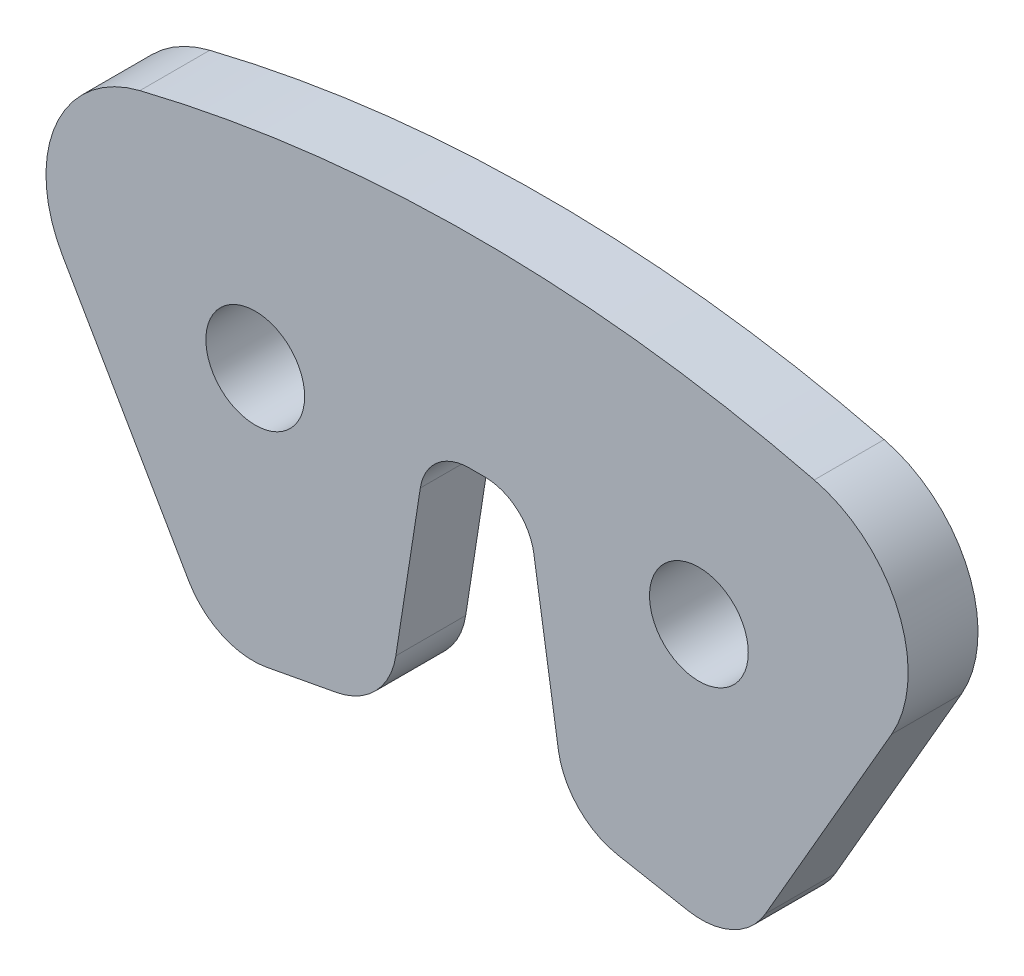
ISO-10303-21;
HEADER;
FILE_DESCRIPTION(('STEP AP214'),'2;1');
FILE_NAME('part.step','',(''),(''),'','','');
FILE_SCHEMA(('AUTOMOTIVE_DESIGN { 1 0 10303 214 1 1 1 1 }'));
ENDSEC;
DATA;
#1=APPLICATION_CONTEXT('core data for automotive mechanical design processes');
#2=APPLICATION_PROTOCOL_DEFINITION('international standard','automotive_design',2000,#1);
#3=PRODUCT_CONTEXT('',#1,'mechanical');
#4=PRODUCT('Part','Part','',(#3));
#5=PRODUCT_RELATED_PRODUCT_CATEGORY('part','',(#4));
#6=PRODUCT_DEFINITION_FORMATION('','',#4);
#7=PRODUCT_DEFINITION_CONTEXT('part definition',#1,'design');
#8=PRODUCT_DEFINITION('design','',#6,#7);
#9=PRODUCT_DEFINITION_SHAPE('','',#8);
#10=(LENGTH_UNIT() NAMED_UNIT(*) SI_UNIT(.MILLI.,.METRE.));
#11=(NAMED_UNIT(*) PLANE_ANGLE_UNIT() SI_UNIT($,.RADIAN.));
#12=(NAMED_UNIT(*) SI_UNIT($,.STERADIAN.) SOLID_ANGLE_UNIT());
#13=UNCERTAINTY_MEASURE_WITH_UNIT(LENGTH_MEASURE(1.E-05),#10,'distance_accuracy_value','');
#14=(GEOMETRIC_REPRESENTATION_CONTEXT(3) GLOBAL_UNCERTAINTY_ASSIGNED_CONTEXT((#13)) GLOBAL_UNIT_ASSIGNED_CONTEXT((#10,
#11,#12)) REPRESENTATION_CONTEXT('',''));
#15=CARTESIAN_POINT('',(0.,0.,0.));
#16=DIRECTION('',(0.,0.,1.));
#17=DIRECTION('',(1.,0.,0.));
#18=AXIS2_PLACEMENT_3D('',#15,#16,#17);
#19=CARTESIAN_POINT('',(0.,0.,0.75));
#20=DIRECTION('',(0.,0.,1.));
#21=DIRECTION('',(1.,0.,0.));
#22=AXIS2_PLACEMENT_3D('',#19,#20,#21);
#23=PLANE('',#22);
#24=CARTESIAN_POINT('',(-4.76250000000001,25.4771247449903,0.75));
#25=DIRECTION('',(0.,0.,1.));
#26=DIRECTION('',(1.,0.,0.));
#27=AXIS2_PLACEMENT_3D('',#24,#25,#26);
#28=CIRCLE('',#27,1.06000000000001);
#29=CARTESIAN_POINT('',(-3.70250000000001,25.4771247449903,0.75));
#30=VERTEX_POINT('',#29);
#31=EDGE_CURVE('E282',#30,#30,#28,.T.);
#32=ORIENTED_EDGE('',*,*,#31,.F.);
#33=EDGE_LOOP('',(#32));
#34=FACE_BOUND('',#33,.T.);
#35=DIRECTION('',(0.982973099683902,-0.183749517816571,0.));
#36=VECTOR('',#35,1.);
#37=CARTESIAN_POINT('',(1.91673165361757,20.5238893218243,0.75));
#38=LINE('',#37,#36);
#39=CARTESIAN_POINT('',(3.02310493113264,20.3170723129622,0.75));
#40=VERTEX_POINT('',#39);
#41=CARTESIAN_POINT('',(4.52041165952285,20.0371771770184,0.75));
#42=VERTEX_POINT('',#41);
#43=EDGE_CURVE('E262',#40,#42,#38,.T.);
#44=ORIENTED_EDGE('',*,*,#43,.T.);
#45=CARTESIAN_POINT('',(4.8125733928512,21.6001044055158,0.75));
#46=DIRECTION('',(0.,0.,1.));
#47=DIRECTION('',(1.,0.,0.));
#48=AXIS2_PLACEMENT_3D('',#45,#46,#47);
#49=CIRCLE('',#48,1.59);
#50=CARTESIAN_POINT('',(6.18955378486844,20.8051044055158,0.75));
#51=VERTEX_POINT('',#50);
#52=EDGE_CURVE('E220',#42,#51,#49,.T.);
#53=ORIENTED_EDGE('',*,*,#52,.T.);
#54=DIRECTION('',(0.500000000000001,0.866025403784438,0.));
#55=VECTOR('',#54,1.);
#56=CARTESIAN_POINT('',(5.62678493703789,19.8303601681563,0.75));
#57=LINE('',#56,#55);
#58=CARTESIAN_POINT('',(8.90061392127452,25.5007983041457,0.75));
#59=VERTEX_POINT('',#58);
#60=EDGE_CURVE('E295',#51,#59,#57,.T.);
#61=ORIENTED_EDGE('',*,*,#60,.T.);
#62=CARTESIAN_POINT('',(6.60564660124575,26.8257983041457,0.75));
#63=DIRECTION('',(0.,0.,1.));
#64=DIRECTION('',(1.,0.,0.));
#65=AXIS2_PLACEMENT_3D('',#62,#63,#64);
#66=CIRCLE('',#65,2.65);
#67=CARTESIAN_POINT('',(7.239261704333,29.3989348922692,0.75));
#68=VERTEX_POINT('',#67);
#69=EDGE_CURVE('E192',#59,#68,#66,.T.);
#70=ORIENTED_EDGE('',*,*,#69,.T.);
#71=CARTESIAN_POINT('',(0.,0.,0.75));
#72=DIRECTION('',(0.,0.,1.));
#73=DIRECTION('',(1.,0.,0.));
#74=AXIS2_PLACEMENT_3D('',#71,#72,#73);
#75=CIRCLE('',#74,30.2771247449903);
#76=CARTESIAN_POINT('',(-7.239261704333,29.3989348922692,0.75));
#77=VERTEX_POINT('',#76);
#78=EDGE_CURVE('E162',#68,#77,#75,.T.);
#79=ORIENTED_EDGE('',*,*,#78,.T.);
#80=CARTESIAN_POINT('',(-6.60564660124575,26.8257983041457,0.75));
#81=DIRECTION('',(0.,0.,1.));
#82=DIRECTION('',(1.,0.,0.));
#83=AXIS2_PLACEMENT_3D('',#80,#81,#82);
#84=CIRCLE('',#83,2.65);
#85=CARTESIAN_POINT('',(-8.90061392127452,25.5007983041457,0.75));
#86=VERTEX_POINT('',#85);
#87=EDGE_CURVE('E190',#77,#86,#84,.T.);
#88=ORIENTED_EDGE('',*,*,#87,.T.);
#89=DIRECTION('',(0.500000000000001,-0.866025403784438,0.));
#90=VECTOR('',#89,1.);
#91=CARTESIAN_POINT('',(-5.62678493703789,19.8303601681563,0.75));
#92=LINE('',#91,#90);
#93=CARTESIAN_POINT('',(-6.18955378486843,20.8051044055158,0.75));
#94=VERTEX_POINT('',#93);
#95=EDGE_CURVE('E278',#86,#94,#92,.T.);
#96=ORIENTED_EDGE('',*,*,#95,.T.);
#97=CARTESIAN_POINT('',(-4.81257339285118,21.6001044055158,0.75));
#98=DIRECTION('',(0.,0.,1.));
#99=DIRECTION('',(1.,0.,0.));
#100=AXIS2_PLACEMENT_3D('',#97,#98,#99);
#101=CIRCLE('',#100,1.59);
#102=CARTESIAN_POINT('',(-4.52041165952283,20.0371771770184,0.75));
#103=VERTEX_POINT('',#102);
#104=EDGE_CURVE('E214',#94,#103,#101,.T.);
#105=ORIENTED_EDGE('',*,*,#104,.T.);
#106=DIRECTION('',(0.982973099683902,0.183749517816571,0.));
#107=VECTOR('',#106,1.);
#108=CARTESIAN_POINT('',(-1.91673165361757,20.5238893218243,0.75));
#109=LINE('',#108,#107);
#110=CARTESIAN_POINT('',(-3.02310493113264,20.3170723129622,0.75));
#111=VERTEX_POINT('',#110);
#112=EDGE_CURVE('E275',#103,#111,#109,.T.);
#113=ORIENTED_EDGE('',*,*,#112,.T.);
#114=CARTESIAN_POINT('',(-3.31526666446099,21.8799995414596,0.75));
#115=DIRECTION('',(0.,0.,1.));
#116=DIRECTION('',(1.,0.,0.));
#117=AXIS2_PLACEMENT_3D('',#114,#115,#116);
#118=CIRCLE('',#117,1.59);
#119=CARTESIAN_POINT('',(-1.74408356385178,21.6361068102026,0.75));
#120=VERTEX_POINT('',#119);
#121=EDGE_CURVE('E216',#111,#120,#118,.T.);
#122=ORIENTED_EDGE('',*,*,#121,.T.);
#123=DIRECTION('',(0.153391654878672,0.988165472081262,0.));
#124=VECTOR('',#123,1.);
#125=CARTESIAN_POINT('',(-1.08285610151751,25.8958049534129,0.75));
#126=LINE('',#125,#124);
#127=CARTESIAN_POINT('',(-1.21873781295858,25.0204404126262,0.75));
#128=VERTEX_POINT('',#127);
#129=EDGE_CURVE('E271',#120,#128,#126,.T.);
#130=ORIENTED_EDGE('',*,*,#129,.T.);
#131=CARTESIAN_POINT('',(-0.171282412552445,24.8578452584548,0.75));
#132=DIRECTION('',(0.,0.,1.));
#133=DIRECTION('',(1.,0.,0.));
#134=AXIS2_PLACEMENT_3D('',#131,#132,#133);
#135=CIRCLE('',#134,1.06);
#136=CARTESIAN_POINT('',(-0.178586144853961,25.9178200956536,0.75));
#137=VERTEX_POINT('',#136);
#138=EDGE_CURVE('E11',#128,#137,#135,.F.);
#139=ORIENTED_EDGE('',*,*,#138,.T.);
#140=CARTESIAN_POINT('',(0.,0.,0.75));
#141=DIRECTION('',(0.,0.,-1.));
#142=DIRECTION('',(1.,0.,0.));
#143=AXIS2_PLACEMENT_3D('',#140,#141,#142);
#144=CIRCLE('',#143,25.918435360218);
#145=CARTESIAN_POINT('',(0.178586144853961,25.9178200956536,0.75));
#146=VERTEX_POINT('',#145);
#147=EDGE_CURVE('E186',#137,#146,#144,.T.);
#148=ORIENTED_EDGE('',*,*,#147,.T.);
#149=CARTESIAN_POINT('',(0.171282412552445,24.8578452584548,0.75));
#150=DIRECTION('',(0.,0.,1.));
#151=DIRECTION('',(1.,0.,0.));
#152=AXIS2_PLACEMENT_3D('',#149,#150,#151);
#153=CIRCLE('',#152,1.06);
#154=CARTESIAN_POINT('',(1.21873781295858,25.0204404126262,0.75));
#155=VERTEX_POINT('',#154);
#156=EDGE_CURVE('E246',#146,#155,#153,.F.);
#157=ORIENTED_EDGE('',*,*,#156,.T.);
#158=DIRECTION('',(0.153391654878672,-0.988165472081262,0.));
#159=VECTOR('',#158,1.);
#160=CARTESIAN_POINT('',(1.08285610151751,25.8958049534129,0.75));
#161=LINE('',#160,#159);
#162=CARTESIAN_POINT('',(1.74408356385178,21.6361068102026,0.75));
#163=VERTEX_POINT('',#162);
#164=EDGE_CURVE('E185',#155,#163,#161,.T.);
#165=ORIENTED_EDGE('',*,*,#164,.T.);
#166=CARTESIAN_POINT('',(3.31526666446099,21.8799995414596,0.75));
#167=DIRECTION('',(0.,0.,1.));
#168=DIRECTION('',(1.,0.,0.));
#169=AXIS2_PLACEMENT_3D('',#166,#167,#168);
#170=CIRCLE('',#169,1.59);
#171=EDGE_CURVE('E218',#163,#40,#170,.T.);
#172=ORIENTED_EDGE('',*,*,#171,.T.);
#173=EDGE_LOOP('',(#44,#53,#61,#70,#79,#88,#96,#105,#113,#122,#130,#139,#148,#157,#165,#172));
#174=FACE_BOUND('',#173,.T.);
#175=CARTESIAN_POINT('',(4.76250000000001,25.4771247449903,0.75));
#176=DIRECTION('',(0.,0.,1.));
#177=DIRECTION('',(1.,0.,0.));
#178=AXIS2_PLACEMENT_3D('',#175,#176,#177);
#179=CIRCLE('',#178,1.06000000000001);
#180=CARTESIAN_POINT('',(5.82250000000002,25.4771247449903,0.75));
#181=VERTEX_POINT('',#180);
#182=EDGE_CURVE('E353',#181,#181,#179,.T.);
#183=ORIENTED_EDGE('',*,*,#182,.F.);
#184=EDGE_LOOP('',(#183));
#185=FACE_BOUND('',#184,.T.);
#186=ADVANCED_FACE('F30',(#34,#174,#185),#23,.T.);
#187=CARTESIAN_POINT('',(0.,0.,-0.75));
#188=DIRECTION('',(0.,0.,1.));
#189=DIRECTION('',(1.,0.,0.));
#190=AXIS2_PLACEMENT_3D('',#187,#188,#189);
#191=PLANE('',#190);
#192=CARTESIAN_POINT('',(-4.76250000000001,25.4771247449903,-0.75));
#193=DIRECTION('',(0.,0.,1.));
#194=DIRECTION('',(1.,0.,0.));
#195=AXIS2_PLACEMENT_3D('',#192,#193,#194);
#196=CIRCLE('',#195,1.06000000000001);
#197=CARTESIAN_POINT('',(-3.70250000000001,25.4771247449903,-0.75));
#198=VERTEX_POINT('',#197);
#199=EDGE_CURVE('E358',#198,#198,#196,.T.);
#200=ORIENTED_EDGE('',*,*,#199,.T.);
#201=EDGE_LOOP('',(#200));
#202=FACE_BOUND('',#201,.T.);
#203=DIRECTION('',(0.499999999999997,0.86602540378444,0.));
#204=VECTOR('',#203,1.);
#205=CARTESIAN_POINT('',(8.11988054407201,24.1485284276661,-0.75));
#206=LINE('',#205,#204);
#207=CARTESIAN_POINT('',(6.18955378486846,20.8051044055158,-0.75));
#208=VERTEX_POINT('',#207);
#209=CARTESIAN_POINT('',(8.90061392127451,25.5007983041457,-0.75));
#210=VERTEX_POINT('',#209);
#211=EDGE_CURVE('E169',#208,#210,#206,.T.);
#212=ORIENTED_EDGE('',*,*,#211,.F.);
#213=CARTESIAN_POINT('',(4.8125733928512,21.6001044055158,-0.75));
#214=DIRECTION('',(0.,0.,1.));
#215=DIRECTION('',(1.,0.,0.));
#216=AXIS2_PLACEMENT_3D('',#213,#214,#215);
#217=CIRCLE('',#216,1.59);
#218=CARTESIAN_POINT('',(4.52041165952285,20.0371771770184,-0.75));
#219=VERTEX_POINT('',#218);
#220=EDGE_CURVE('E207',#208,#219,#217,.F.);
#221=ORIENTED_EDGE('',*,*,#220,.T.);
#222=DIRECTION('',(0.982973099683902,-0.183749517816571,0.));
#223=VECTOR('',#222,1.);
#224=CARTESIAN_POINT('',(1.91673165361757,20.5238893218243,-0.75));
#225=LINE('',#224,#223);
#226=CARTESIAN_POINT('',(3.02310493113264,20.3170723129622,-0.75));
#227=VERTEX_POINT('',#226);
#228=EDGE_CURVE('E174',#227,#219,#225,.T.);
#229=ORIENTED_EDGE('',*,*,#228,.F.);
#230=CARTESIAN_POINT('',(3.31526666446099,21.8799995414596,-0.75));
#231=DIRECTION('',(0.,0.,1.));
#232=DIRECTION('',(1.,0.,0.));
#233=AXIS2_PLACEMENT_3D('',#230,#231,#232);
#234=CIRCLE('',#233,1.59);
#235=CARTESIAN_POINT('',(1.74408356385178,21.6361068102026,-0.75));
#236=VERTEX_POINT('',#235);
#237=EDGE_CURVE('E204',#227,#236,#234,.F.);
#238=ORIENTED_EDGE('',*,*,#237,.T.);
#239=DIRECTION('',(0.153391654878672,-0.988165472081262,0.));
#240=VECTOR('',#239,1.);
#241=CARTESIAN_POINT('',(1.08285610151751,25.8958049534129,-0.75));
#242=LINE('',#241,#240);
#243=CARTESIAN_POINT('',(1.21873781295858,25.0204404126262,-0.75));
#244=VERTEX_POINT('',#243);
#245=EDGE_CURVE('E265',#244,#236,#242,.T.);
#246=ORIENTED_EDGE('',*,*,#245,.F.);
#247=CARTESIAN_POINT('',(0.171282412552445,24.8578452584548,-0.75));
#248=DIRECTION('',(0.,0.,1.));
#249=DIRECTION('',(1.,0.,0.));
#250=AXIS2_PLACEMENT_3D('',#247,#248,#249);
#251=CIRCLE('',#250,1.06);
#252=CARTESIAN_POINT('',(0.178586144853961,25.9178200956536,-0.75));
#253=VERTEX_POINT('',#252);
#254=EDGE_CURVE('E244',#244,#253,#251,.T.);
#255=ORIENTED_EDGE('',*,*,#254,.T.);
#256=CARTESIAN_POINT('',(0.,0.,-0.75));
#257=DIRECTION('',(0.,0.,-1.));
#258=DIRECTION('',(1.,0.,0.));
#259=AXIS2_PLACEMENT_3D('',#256,#257,#258);
#260=CIRCLE('',#259,25.918435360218);
#261=CARTESIAN_POINT('',(-0.178586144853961,25.9178200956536,-0.75));
#262=VERTEX_POINT('',#261);
#263=EDGE_CURVE('E182',#262,#253,#260,.T.);
#264=ORIENTED_EDGE('',*,*,#263,.F.);
#265=CARTESIAN_POINT('',(-0.171282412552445,24.8578452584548,-0.75));
#266=DIRECTION('',(0.,0.,1.));
#267=DIRECTION('',(1.,0.,0.));
#268=AXIS2_PLACEMENT_3D('',#265,#266,#267);
#269=CIRCLE('',#268,1.06);
#270=CARTESIAN_POINT('',(-1.21873781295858,25.0204404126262,-0.75));
#271=VERTEX_POINT('',#270);
#272=EDGE_CURVE('E38',#262,#271,#269,.T.);
#273=ORIENTED_EDGE('',*,*,#272,.T.);
#274=DIRECTION('',(0.153391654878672,0.988165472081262,0.));
#275=VECTOR('',#274,1.);
#276=CARTESIAN_POINT('',(-1.08285610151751,25.8958049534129,-0.75));
#277=LINE('',#276,#275);
#278=CARTESIAN_POINT('',(-1.74408356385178,21.6361068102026,-0.75));
#279=VERTEX_POINT('',#278);
#280=EDGE_CURVE('E180',#279,#271,#277,.T.);
#281=ORIENTED_EDGE('',*,*,#280,.F.);
#282=CARTESIAN_POINT('',(-3.31526666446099,21.8799995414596,-0.75));
#283=DIRECTION('',(0.,0.,1.));
#284=DIRECTION('',(1.,0.,0.));
#285=AXIS2_PLACEMENT_3D('',#282,#283,#284);
#286=CIRCLE('',#285,1.59);
#287=CARTESIAN_POINT('',(-3.02310493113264,20.3170723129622,-0.75));
#288=VERTEX_POINT('',#287);
#289=EDGE_CURVE('E202',#279,#288,#286,.F.);
#290=ORIENTED_EDGE('',*,*,#289,.T.);
#291=DIRECTION('',(0.982973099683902,0.183749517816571,0.));
#292=VECTOR('',#291,1.);
#293=CARTESIAN_POINT('',(-1.91673165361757,20.5238893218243,-0.75));
#294=LINE('',#293,#292);
#295=CARTESIAN_POINT('',(-4.52041165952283,20.0371771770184,-0.75));
#296=VERTEX_POINT('',#295);
#297=EDGE_CURVE('E172',#296,#288,#294,.T.);
#298=ORIENTED_EDGE('',*,*,#297,.F.);
#299=CARTESIAN_POINT('',(-4.81257339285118,21.6001044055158,-0.75));
#300=DIRECTION('',(0.,0.,1.));
#301=DIRECTION('',(1.,0.,0.));
#302=AXIS2_PLACEMENT_3D('',#299,#300,#301);
#303=CIRCLE('',#302,1.59);
#304=CARTESIAN_POINT('',(-6.18955378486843,20.8051044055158,-0.75));
#305=VERTEX_POINT('',#304);
#306=EDGE_CURVE('E200',#296,#305,#303,.F.);
#307=ORIENTED_EDGE('',*,*,#306,.T.);
#308=DIRECTION('',(0.500000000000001,-0.866025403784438,0.));
#309=VECTOR('',#308,1.);
#310=CARTESIAN_POINT('',(-5.62678493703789,19.8303601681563,-0.75));
#311=LINE('',#310,#309);
#312=CARTESIAN_POINT('',(-8.90061392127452,25.5007983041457,-0.75));
#313=VERTEX_POINT('',#312);
#314=EDGE_CURVE('E168',#313,#305,#311,.T.);
#315=ORIENTED_EDGE('',*,*,#314,.F.);
#316=CARTESIAN_POINT('',(-6.60564660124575,26.8257983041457,-0.75));
#317=DIRECTION('',(0.,0.,1.));
#318=DIRECTION('',(1.,0.,0.));
#319=AXIS2_PLACEMENT_3D('',#316,#317,#318);
#320=CIRCLE('',#319,2.65);
#321=CARTESIAN_POINT('',(-7.239261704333,29.3989348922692,-0.75));
#322=VERTEX_POINT('',#321);
#323=EDGE_CURVE('E153',#313,#322,#320,.F.);
#324=ORIENTED_EDGE('',*,*,#323,.T.);
#325=CARTESIAN_POINT('',(0.,0.,-0.75));
#326=DIRECTION('',(0.,0.,1.));
#327=DIRECTION('',(1.,0.,0.));
#328=AXIS2_PLACEMENT_3D('',#325,#326,#327);
#329=CIRCLE('',#328,30.2771247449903);
#330=CARTESIAN_POINT('',(7.239261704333,29.3989348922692,-0.75));
#331=VERTEX_POINT('',#330);
#332=EDGE_CURVE('E159',#331,#322,#329,.T.);
#333=ORIENTED_EDGE('',*,*,#332,.F.);
#334=CARTESIAN_POINT('',(6.60564660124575,26.8257983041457,-0.75));
#335=DIRECTION('',(0.,0.,1.));
#336=DIRECTION('',(1.,0.,0.));
#337=AXIS2_PLACEMENT_3D('',#334,#335,#336);
#338=CIRCLE('',#337,2.65);
#339=EDGE_CURVE('E144',#331,#210,#338,.F.);
#340=ORIENTED_EDGE('',*,*,#339,.T.);
#341=EDGE_LOOP('',(#212,#221,#229,#238,#246,#255,#264,#273,#281,#290,#298,#307,#315,#324,#333,#340));
#342=FACE_BOUND('',#341,.T.);
#343=CARTESIAN_POINT('',(4.76250000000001,25.4771247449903,-0.75));
#344=DIRECTION('',(0.,0.,1.));
#345=DIRECTION('',(1.,0.,0.));
#346=AXIS2_PLACEMENT_3D('',#343,#344,#345);
#347=CIRCLE('',#346,1.06000000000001);
#348=CARTESIAN_POINT('',(5.82250000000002,25.4771247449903,-0.75));
#349=VERTEX_POINT('',#348);
#350=EDGE_CURVE('E356',#349,#349,#347,.T.);
#351=ORIENTED_EDGE('',*,*,#350,.T.);
#352=EDGE_LOOP('',(#351));
#353=FACE_BOUND('',#352,.T.);
#354=ADVANCED_FACE('F165',(#202,#342,#353),#191,.F.);
#355=CARTESIAN_POINT('',(1.08285610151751,25.8958049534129,0.75));
#356=DIRECTION('',(0.988165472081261,0.153391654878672,0.));
#357=DIRECTION('',(-0.153391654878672,0.988165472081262,0.));
#358=AXIS2_PLACEMENT_3D('',#355,#356,#357);
#359=PLANE('',#358);
#360=ORIENTED_EDGE('',*,*,#164,.F.);
#361=DIRECTION('',(0.,0.,1.));
#362=VECTOR('',#361,1.);
#363=CARTESIAN_POINT('',(1.21873781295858,25.0204404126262,-0.75));
#364=LINE('',#363,#362);
#365=EDGE_CURVE('E235',#155,#244,#364,.F.);
#366=ORIENTED_EDGE('',*,*,#365,.T.);
#367=ORIENTED_EDGE('',*,*,#245,.T.);
#368=DIRECTION('',(0.,0.,-1.));
#369=VECTOR('',#368,1.);
#370=CARTESIAN_POINT('',(1.74408356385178,21.6361068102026,0.75));
#371=LINE('',#370,#369);
#372=EDGE_CURVE('E222',#236,#163,#371,.F.);
#373=ORIENTED_EDGE('',*,*,#372,.T.);
#374=EDGE_LOOP('',(#360,#366,#367,#373));
#375=FACE_BOUND('',#374,.T.);
#376=ADVANCED_FACE('F258',(#375),#359,.F.);
#377=CARTESIAN_POINT('',(1.91673165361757,20.5238893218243,0.75));
#378=DIRECTION('',(0.183749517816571,0.982973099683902,0.));
#379=DIRECTION('',(-0.982973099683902,0.183749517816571,0.));
#380=AXIS2_PLACEMENT_3D('',#377,#378,#379);
#381=PLANE('',#380);
#382=ORIENTED_EDGE('',*,*,#228,.T.);
#383=DIRECTION('',(0.,0.,-1.));
#384=VECTOR('',#383,1.);
#385=CARTESIAN_POINT('',(4.52041165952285,20.0371771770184,0.75));
#386=LINE('',#385,#384);
#387=EDGE_CURVE('E212',#219,#42,#386,.F.);
#388=ORIENTED_EDGE('',*,*,#387,.T.);
#389=ORIENTED_EDGE('',*,*,#43,.F.);
#390=DIRECTION('',(0.,0.,-1.));
#391=VECTOR('',#390,1.);
#392=CARTESIAN_POINT('',(3.02310493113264,20.3170723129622,0.75));
#393=LINE('',#392,#391);
#394=EDGE_CURVE('E209',#40,#227,#393,.T.);
#395=ORIENTED_EDGE('',*,*,#394,.T.);
#396=EDGE_LOOP('',(#382,#388,#389,#395));
#397=FACE_BOUND('',#396,.T.);
#398=ADVANCED_FACE('F287',(#397),#381,.F.);
#399=CARTESIAN_POINT('',(8.11988054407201,24.1485284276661,0.75));
#400=DIRECTION('',(-0.86602540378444,0.499999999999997,0.));
#401=DIRECTION('',(-0.499999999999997,-0.86602540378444,0.));
#402=AXIS2_PLACEMENT_3D('',#399,#400,#401);
#403=PLANE('',#402);
#404=ORIENTED_EDGE('',*,*,#60,.F.);
#405=DIRECTION('',(0.,0.,-1.));
#406=VECTOR('',#405,1.);
#407=CARTESIAN_POINT('',(6.18955378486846,20.8051044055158,0.75));
#408=LINE('',#407,#406);
#409=EDGE_CURVE('E197',#51,#208,#408,.T.);
#410=ORIENTED_EDGE('',*,*,#409,.T.);
#411=ORIENTED_EDGE('',*,*,#211,.T.);
#412=DIRECTION('',(0.,0.,-1.));
#413=VECTOR('',#412,1.);
#414=CARTESIAN_POINT('',(8.90061392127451,25.5007983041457,0.75));
#415=LINE('',#414,#413);
#416=EDGE_CURVE('E150',#210,#59,#415,.F.);
#417=ORIENTED_EDGE('',*,*,#416,.T.);
#418=EDGE_LOOP('',(#404,#410,#411,#417));
#419=FACE_BOUND('',#418,.T.);
#420=ADVANCED_FACE('F297',(#419),#403,.F.);
#421=CARTESIAN_POINT('',(0.,0.,0.75));
#422=DIRECTION('',(0.,0.,-1.));
#423=DIRECTION('',(-1.,0.,0.));
#424=AXIS2_PLACEMENT_3D('',#421,#422,#423);
#425=CYLINDRICAL_SURFACE('',#424,30.2771247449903);
#426=ORIENTED_EDGE('',*,*,#78,.F.);
#427=DIRECTION('',(0.,0.,-1.));
#428=VECTOR('',#427,1.);
#429=CARTESIAN_POINT('',(7.239261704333,29.3989348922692,0.75));
#430=LINE('',#429,#428);
#431=EDGE_CURVE('E148',#68,#331,#430,.T.);
#432=ORIENTED_EDGE('',*,*,#431,.T.);
#433=ORIENTED_EDGE('',*,*,#332,.T.);
#434=DIRECTION('',(0.,0.,-1.));
#435=VECTOR('',#434,1.);
#436=CARTESIAN_POINT('',(-7.239261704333,29.3989348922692,0.75));
#437=LINE('',#436,#435);
#438=EDGE_CURVE('E163',#322,#77,#437,.F.);
#439=ORIENTED_EDGE('',*,*,#438,.T.);
#440=EDGE_LOOP('',(#426,#432,#433,#439));
#441=FACE_BOUND('',#440,.T.);
#442=ADVANCED_FACE('F158',(#441),#425,.T.);
#443=CARTESIAN_POINT('',(-5.62678493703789,19.8303601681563,0.75));
#444=DIRECTION('',(0.866025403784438,0.500000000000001,0.));
#445=DIRECTION('',(-0.500000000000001,0.866025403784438,0.));
#446=AXIS2_PLACEMENT_3D('',#443,#444,#445);
#447=PLANE('',#446);
#448=ORIENTED_EDGE('',*,*,#314,.T.);
#449=DIRECTION('',(0.,0.,-1.));
#450=VECTOR('',#449,1.);
#451=CARTESIAN_POINT('',(-6.18955378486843,20.8051044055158,0.75));
#452=LINE('',#451,#450);
#453=EDGE_CURVE('E233',#305,#94,#452,.F.);
#454=ORIENTED_EDGE('',*,*,#453,.T.);
#455=ORIENTED_EDGE('',*,*,#95,.F.);
#456=DIRECTION('',(0.,0.,-1.));
#457=VECTOR('',#456,1.);
#458=CARTESIAN_POINT('',(-8.90061392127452,25.5007983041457,0.75));
#459=LINE('',#458,#457);
#460=EDGE_CURVE('E194',#86,#313,#459,.T.);
#461=ORIENTED_EDGE('',*,*,#460,.T.);
#462=EDGE_LOOP('',(#448,#454,#455,#461));
#463=FACE_BOUND('',#462,.T.);
#464=ADVANCED_FACE('F327',(#463),#447,.F.);
#465=CARTESIAN_POINT('',(-1.91673165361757,20.5238893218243,0.75));
#466=DIRECTION('',(-0.183749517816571,0.982973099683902,0.));
#467=DIRECTION('',(-0.982973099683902,-0.183749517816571,0.));
#468=AXIS2_PLACEMENT_3D('',#465,#466,#467);
#469=PLANE('',#468);
#470=ORIENTED_EDGE('',*,*,#297,.T.);
#471=DIRECTION('',(0.,0.,-1.));
#472=VECTOR('',#471,1.);
#473=CARTESIAN_POINT('',(-3.02310493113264,20.3170723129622,0.75));
#474=LINE('',#473,#472);
#475=EDGE_CURVE('E231',#288,#111,#474,.F.);
#476=ORIENTED_EDGE('',*,*,#475,.T.);
#477=ORIENTED_EDGE('',*,*,#112,.F.);
#478=DIRECTION('',(0.,0.,-1.));
#479=VECTOR('',#478,1.);
#480=CARTESIAN_POINT('',(-4.52041165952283,20.0371771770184,0.75));
#481=LINE('',#480,#479);
#482=EDGE_CURVE('E228',#103,#296,#481,.T.);
#483=ORIENTED_EDGE('',*,*,#482,.T.);
#484=EDGE_LOOP('',(#470,#476,#477,#483));
#485=FACE_BOUND('',#484,.T.);
#486=ADVANCED_FACE('F314',(#485),#469,.F.);
#487=CARTESIAN_POINT('',(-1.08285610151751,25.8958049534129,0.75));
#488=DIRECTION('',(-0.988165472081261,0.153391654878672,0.));
#489=DIRECTION('',(-0.153391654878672,-0.988165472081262,0.));
#490=AXIS2_PLACEMENT_3D('',#487,#488,#489);
#491=PLANE('',#490);
#492=ORIENTED_EDGE('',*,*,#280,.T.);
#493=DIRECTION('',(0.,0.,1.));
#494=VECTOR('',#493,1.);
#495=CARTESIAN_POINT('',(-1.21873781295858,25.0204404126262,0.75));
#496=LINE('',#495,#494);
#497=EDGE_CURVE('E51',#271,#128,#496,.T.);
#498=ORIENTED_EDGE('',*,*,#497,.T.);
#499=ORIENTED_EDGE('',*,*,#129,.F.);
#500=DIRECTION('',(0.,0.,-1.));
#501=VECTOR('',#500,1.);
#502=CARTESIAN_POINT('',(-1.74408356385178,21.6361068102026,0.75));
#503=LINE('',#502,#501);
#504=EDGE_CURVE('E225',#120,#279,#503,.T.);
#505=ORIENTED_EDGE('',*,*,#504,.T.);
#506=EDGE_LOOP('',(#492,#498,#499,#505));
#507=FACE_BOUND('',#506,.T.);
#508=ADVANCED_FACE('F318',(#507),#491,.F.);
#509=CARTESIAN_POINT('',(0.,0.,0.75));
#510=DIRECTION('',(0.,0.,-1.));
#511=DIRECTION('',(-1.,0.,0.));
#512=AXIS2_PLACEMENT_3D('',#509,#510,#511);
#513=CYLINDRICAL_SURFACE('',#512,25.918435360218);
#514=ORIENTED_EDGE('',*,*,#263,.T.);
#515=DIRECTION('',(0.,0.,-1.));
#516=VECTOR('',#515,1.);
#517=CARTESIAN_POINT('',(0.178586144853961,25.9178200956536,0.75));
#518=LINE('',#517,#516);
#519=EDGE_CURVE('E241',#253,#146,#518,.F.);
#520=ORIENTED_EDGE('',*,*,#519,.T.);
#521=ORIENTED_EDGE('',*,*,#147,.F.);
#522=DIRECTION('',(0.,0.,-1.));
#523=VECTOR('',#522,1.);
#524=CARTESIAN_POINT('',(-0.178586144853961,25.9178200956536,0.75));
#525=LINE('',#524,#523);
#526=EDGE_CURVE('E238',#137,#262,#525,.T.);
#527=ORIENTED_EDGE('',*,*,#526,.T.);
#528=EDGE_LOOP('',(#514,#520,#521,#527));
#529=FACE_BOUND('',#528,.T.);
#530=ADVANCED_FACE('F267',(#529),#513,.F.);
#531=CARTESIAN_POINT('',(-4.76250000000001,25.4771247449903,0.75));
#532=DIRECTION('',(0.,0.,-1.));
#533=DIRECTION('',(-1.,0.,0.));
#534=AXIS2_PLACEMENT_3D('',#531,#532,#533);
#535=CYLINDRICAL_SURFACE('',#534,1.06000000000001);
#536=ORIENTED_EDGE('',*,*,#31,.T.);
#537=EDGE_LOOP('',(#536));
#538=FACE_BOUND('',#537,.T.);
#539=ORIENTED_EDGE('',*,*,#199,.F.);
#540=EDGE_LOOP('',(#539));
#541=FACE_BOUND('',#540,.T.);
#542=ADVANCED_FACE('F325',(#538,#541),#535,.F.);
#543=CARTESIAN_POINT('',(4.76250000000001,25.4771247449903,0.75));
#544=DIRECTION('',(0.,0.,-1.));
#545=DIRECTION('',(-1.,0.,0.));
#546=AXIS2_PLACEMENT_3D('',#543,#544,#545);
#547=CYLINDRICAL_SURFACE('',#546,1.06000000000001);
#548=ORIENTED_EDGE('',*,*,#182,.T.);
#549=EDGE_LOOP('',(#548));
#550=FACE_BOUND('',#549,.T.);
#551=ORIENTED_EDGE('',*,*,#350,.F.);
#552=EDGE_LOOP('',(#551));
#553=FACE_BOUND('',#552,.T.);
#554=ADVANCED_FACE('F341',(#550,#553),#547,.F.);
#555=CARTESIAN_POINT('',(6.60564660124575,26.8257983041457,0.75));
#556=DIRECTION('',(0.,0.,-1.));
#557=DIRECTION('',(-1.,0.,0.));
#558=AXIS2_PLACEMENT_3D('',#555,#556,#557);
#559=CYLINDRICAL_SURFACE('',#558,2.65);
#560=ORIENTED_EDGE('',*,*,#69,.F.);
#561=ORIENTED_EDGE('',*,*,#416,.F.);
#562=ORIENTED_EDGE('',*,*,#339,.F.);
#563=ORIENTED_EDGE('',*,*,#431,.F.);
#564=EDGE_LOOP('',(#560,#561,#562,#563));
#565=FACE_BOUND('',#564,.T.);
#566=ADVANCED_FACE('F147',(#565),#559,.T.);
#567=CARTESIAN_POINT('',(-6.60564660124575,26.8257983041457,0.75));
#568=DIRECTION('',(0.,0.,-1.));
#569=DIRECTION('',(-1.,0.,0.));
#570=AXIS2_PLACEMENT_3D('',#567,#568,#569);
#571=CYLINDRICAL_SURFACE('',#570,2.65);
#572=ORIENTED_EDGE('',*,*,#87,.F.);
#573=ORIENTED_EDGE('',*,*,#438,.F.);
#574=ORIENTED_EDGE('',*,*,#323,.F.);
#575=ORIENTED_EDGE('',*,*,#460,.F.);
#576=EDGE_LOOP('',(#572,#573,#574,#575));
#577=FACE_BOUND('',#576,.T.);
#578=ADVANCED_FACE('F348',(#577),#571,.T.);
#579=CARTESIAN_POINT('',(4.8125733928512,21.6001044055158,0.75));
#580=DIRECTION('',(0.,0.,-1.));
#581=DIRECTION('',(-1.,0.,0.));
#582=AXIS2_PLACEMENT_3D('',#579,#580,#581);
#583=CYLINDRICAL_SURFACE('',#582,1.59);
#584=ORIENTED_EDGE('',*,*,#52,.F.);
#585=ORIENTED_EDGE('',*,*,#387,.F.);
#586=ORIENTED_EDGE('',*,*,#220,.F.);
#587=ORIENTED_EDGE('',*,*,#409,.F.);
#588=EDGE_LOOP('',(#584,#585,#586,#587));
#589=FACE_BOUND('',#588,.T.);
#590=ADVANCED_FACE('F292',(#589),#583,.T.);
#591=CARTESIAN_POINT('',(3.31526666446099,21.8799995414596,0.75));
#592=DIRECTION('',(0.,0.,-1.));
#593=DIRECTION('',(-1.,0.,0.));
#594=AXIS2_PLACEMENT_3D('',#591,#592,#593);
#595=CYLINDRICAL_SURFACE('',#594,1.59);
#596=ORIENTED_EDGE('',*,*,#171,.F.);
#597=ORIENTED_EDGE('',*,*,#372,.F.);
#598=ORIENTED_EDGE('',*,*,#237,.F.);
#599=ORIENTED_EDGE('',*,*,#394,.F.);
#600=EDGE_LOOP('',(#596,#597,#598,#599));
#601=FACE_BOUND('',#600,.T.);
#602=ADVANCED_FACE('F376',(#601),#595,.T.);
#603=CARTESIAN_POINT('',(-3.31526666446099,21.8799995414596,0.75));
#604=DIRECTION('',(0.,0.,-1.));
#605=DIRECTION('',(-1.,0.,0.));
#606=AXIS2_PLACEMENT_3D('',#603,#604,#605);
#607=CYLINDRICAL_SURFACE('',#606,1.59);
#608=ORIENTED_EDGE('',*,*,#121,.F.);
#609=ORIENTED_EDGE('',*,*,#475,.F.);
#610=ORIENTED_EDGE('',*,*,#289,.F.);
#611=ORIENTED_EDGE('',*,*,#504,.F.);
#612=EDGE_LOOP('',(#608,#609,#610,#611));
#613=FACE_BOUND('',#612,.T.);
#614=ADVANCED_FACE('F317',(#613),#607,.T.);
#615=CARTESIAN_POINT('',(-4.81257339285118,21.6001044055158,0.75));
#616=DIRECTION('',(0.,0.,-1.));
#617=DIRECTION('',(-1.,0.,0.));
#618=AXIS2_PLACEMENT_3D('',#615,#616,#617);
#619=CYLINDRICAL_SURFACE('',#618,1.59);
#620=ORIENTED_EDGE('',*,*,#104,.F.);
#621=ORIENTED_EDGE('',*,*,#453,.F.);
#622=ORIENTED_EDGE('',*,*,#306,.F.);
#623=ORIENTED_EDGE('',*,*,#482,.F.);
#624=EDGE_LOOP('',(#620,#621,#622,#623));
#625=FACE_BOUND('',#624,.T.);
#626=ADVANCED_FACE('F311',(#625),#619,.T.);
#627=CARTESIAN_POINT('',(0.171282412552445,24.8578452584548,0.75));
#628=DIRECTION('',(0.,0.,-1.));
#629=DIRECTION('',(-1.,0.,0.));
#630=AXIS2_PLACEMENT_3D('',#627,#628,#629);
#631=CYLINDRICAL_SURFACE('',#630,1.06);
#632=ORIENTED_EDGE('',*,*,#156,.F.);
#633=ORIENTED_EDGE('',*,*,#519,.F.);
#634=ORIENTED_EDGE('',*,*,#254,.F.);
#635=ORIENTED_EDGE('',*,*,#365,.F.);
#636=EDGE_LOOP('',(#632,#633,#634,#635));
#637=FACE_BOUND('',#636,.T.);
#638=ADVANCED_FACE('F264',(#637),#631,.F.);
#639=CARTESIAN_POINT('',(-0.171282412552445,24.8578452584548,0.75));
#640=DIRECTION('',(0.,0.,-1.));
#641=DIRECTION('',(-1.,0.,0.));
#642=AXIS2_PLACEMENT_3D('',#639,#640,#641);
#643=CYLINDRICAL_SURFACE('',#642,1.06);
#644=ORIENTED_EDGE('',*,*,#138,.F.);
#645=ORIENTED_EDGE('',*,*,#497,.F.);
#646=ORIENTED_EDGE('',*,*,#272,.F.);
#647=ORIENTED_EDGE('',*,*,#526,.F.);
#648=EDGE_LOOP('',(#644,#645,#646,#647));
#649=FACE_BOUND('',#648,.T.);
#650=ADVANCED_FACE('F32',(#649),#643,.F.);
#651=CLOSED_SHELL('',(#186,#354,#376,#398,#420,#442,#464,#486,#508,#530,#542,#554,#566,#578,
#590,#602,#614,#626,#638,#650));
#652=MANIFOLD_SOLID_BREP('B2',#651);
#653=ADVANCED_BREP_SHAPE_REPRESENTATION('',(#18,#652),#14);
#654=SHAPE_DEFINITION_REPRESENTATION(#9,#653);
ENDSEC;
END-ISO-10303-21;
